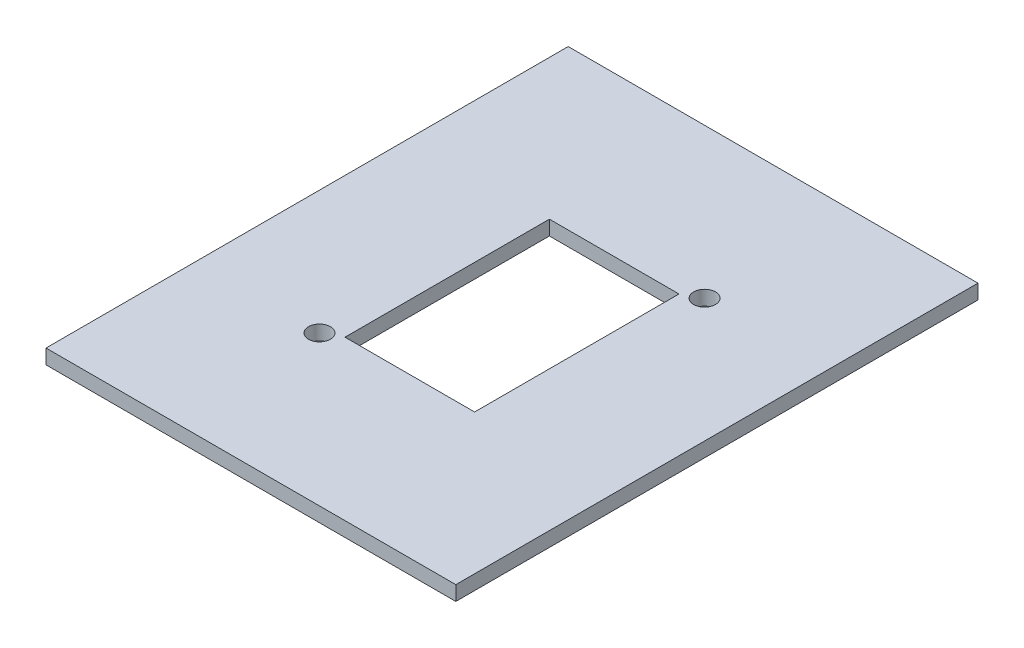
ISO-10303-21;
HEADER;
FILE_DESCRIPTION(('STEP AP214'),'2;1');
FILE_NAME('part.step','',(''),(''),'','','');
FILE_SCHEMA(('AUTOMOTIVE_DESIGN { 1 0 10303 214 1 1 1 1 }'));
ENDSEC;
DATA;
#1=APPLICATION_CONTEXT('core data for automotive mechanical design processes');
#2=APPLICATION_PROTOCOL_DEFINITION('international standard','automotive_design',2000,#1);
#3=PRODUCT_CONTEXT('',#1,'mechanical');
#4=PRODUCT('Part','Part','',(#3));
#5=PRODUCT_RELATED_PRODUCT_CATEGORY('part','',(#4));
#6=PRODUCT_DEFINITION_FORMATION('','',#4);
#7=PRODUCT_DEFINITION_CONTEXT('part definition',#1,'design');
#8=PRODUCT_DEFINITION('design','',#6,#7);
#9=PRODUCT_DEFINITION_SHAPE('','',#8);
#10=(LENGTH_UNIT() NAMED_UNIT(*) SI_UNIT(.MILLI.,.METRE.));
#11=(NAMED_UNIT(*) PLANE_ANGLE_UNIT() SI_UNIT($,.RADIAN.));
#12=(NAMED_UNIT(*) SI_UNIT($,.STERADIAN.) SOLID_ANGLE_UNIT());
#13=UNCERTAINTY_MEASURE_WITH_UNIT(LENGTH_MEASURE(1.E-05),#10,'distance_accuracy_value','');
#14=(GEOMETRIC_REPRESENTATION_CONTEXT(3) GLOBAL_UNCERTAINTY_ASSIGNED_CONTEXT((#13)) GLOBAL_UNIT_ASSIGNED_CONTEXT((#10,
#11,#12)) REPRESENTATION_CONTEXT('',''));
#15=CARTESIAN_POINT('',(0.,0.,0.));
#16=DIRECTION('',(0.,0.,1.));
#17=DIRECTION('',(1.,0.,0.));
#18=AXIS2_PLACEMENT_3D('',#15,#16,#17);
#19=CARTESIAN_POINT('',(0.,2.,0.));
#20=DIRECTION('',(0.,1.,0.));
#21=DIRECTION('',(0.,0.,1.));
#22=AXIS2_PLACEMENT_3D('',#19,#20,#21);
#23=PLANE('',#22);
#24=CARTESIAN_POINT('',(11.125,2.,-15.25));
#25=DIRECTION('',(0.,1.,0.));
#26=DIRECTION('',(0.,0.,1.));
#27=AXIS2_PLACEMENT_3D('',#24,#25,#26);
#28=CIRCLE('',#27,1.5);
#29=CARTESIAN_POINT('',(11.125,2.,-13.75));
#30=VERTEX_POINT('',#29);
#31=EDGE_CURVE('E140',#30,#30,#28,.T.);
#32=ORIENTED_EDGE('',*,*,#31,.F.);
#33=EDGE_LOOP('',(#32));
#34=FACE_BOUND('',#33,.T.);
#35=DIRECTION('',(0.,0.,-1.));
#36=VECTOR('',#35,1.);
#37=CARTESIAN_POINT('',(28.067645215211,2.,-35.7649394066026));
#38=LINE('',#37,#36);
#39=CARTESIAN_POINT('',(28.067645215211,2.,35.7649394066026));
#40=VERTEX_POINT('',#39);
#41=CARTESIAN_POINT('',(28.067645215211,2.,-35.7649394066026));
#42=VERTEX_POINT('',#41);
#43=EDGE_CURVE('E156',#40,#42,#38,.T.);
#44=ORIENTED_EDGE('',*,*,#43,.T.);
#45=DIRECTION('',(-1.,0.,0.));
#46=VECTOR('',#45,1.);
#47=CARTESIAN_POINT('',(-28.067645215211,2.,-35.7649394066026));
#48=LINE('',#47,#46);
#49=CARTESIAN_POINT('',(-28.067645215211,2.,-35.7649394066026));
#50=VERTEX_POINT('',#49);
#51=EDGE_CURVE('E160',#42,#50,#48,.T.);
#52=ORIENTED_EDGE('',*,*,#51,.T.);
#53=DIRECTION('',(0.,0.,1.));
#54=VECTOR('',#53,1.);
#55=CARTESIAN_POINT('',(-28.067645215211,2.,-35.7649394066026));
#56=LINE('',#55,#54);
#57=CARTESIAN_POINT('',(-28.067645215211,2.,35.7649394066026));
#58=VERTEX_POINT('',#57);
#59=EDGE_CURVE('E164',#50,#58,#56,.T.);
#60=ORIENTED_EDGE('',*,*,#59,.T.);
#61=DIRECTION('',(1.,0.,0.));
#62=VECTOR('',#61,1.);
#63=CARTESIAN_POINT('',(-28.067645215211,2.,35.7649394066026));
#64=LINE('',#63,#62);
#65=EDGE_CURVE('E167',#58,#40,#64,.T.);
#66=ORIENTED_EDGE('',*,*,#65,.T.);
#67=EDGE_LOOP('',(#44,#52,#60,#66));
#68=FACE_BOUND('',#67,.T.);
#69=DIRECTION('',(-1.,0.,0.));
#70=VECTOR('',#69,1.);
#71=CARTESIAN_POINT('',(-8.875,2.,-14.));
#72=LINE('',#71,#70);
#73=CARTESIAN_POINT('',(8.875,2.,-14.));
#74=VERTEX_POINT('',#73);
#75=CARTESIAN_POINT('',(-8.875,2.,-14.));
#76=VERTEX_POINT('',#75);
#77=EDGE_CURVE('E114',#74,#76,#72,.T.);
#78=ORIENTED_EDGE('',*,*,#77,.F.);
#79=DIRECTION('',(0.,0.,-1.));
#80=VECTOR('',#79,1.);
#81=CARTESIAN_POINT('',(8.875,2.,-14.));
#82=LINE('',#81,#80);
#83=CARTESIAN_POINT('',(8.875,2.,14.));
#84=VERTEX_POINT('',#83);
#85=EDGE_CURVE('E105',#84,#74,#82,.T.);
#86=ORIENTED_EDGE('',*,*,#85,.F.);
#87=DIRECTION('',(1.,0.,0.));
#88=VECTOR('',#87,1.);
#89=CARTESIAN_POINT('',(-8.875,2.,14.));
#90=LINE('',#89,#88);
#91=CARTESIAN_POINT('',(-8.875,2.,14.));
#92=VERTEX_POINT('',#91);
#93=EDGE_CURVE('E132',#92,#84,#90,.T.);
#94=ORIENTED_EDGE('',*,*,#93,.F.);
#95=DIRECTION('',(0.,0.,1.));
#96=VECTOR('',#95,1.);
#97=CARTESIAN_POINT('',(-8.875,2.,-14.));
#98=LINE('',#97,#96);
#99=EDGE_CURVE('E128',#76,#92,#98,.T.);
#100=ORIENTED_EDGE('',*,*,#99,.F.);
#101=EDGE_LOOP('',(#78,#86,#94,#100));
#102=FACE_BOUND('',#101,.T.);
#103=CARTESIAN_POINT('',(-11.125,2.,15.25));
#104=DIRECTION('',(0.,1.,0.));
#105=DIRECTION('',(0.,0.,1.));
#106=AXIS2_PLACEMENT_3D('',#103,#104,#105);
#107=CIRCLE('',#106,1.5);
#108=CARTESIAN_POINT('',(-11.125,2.,16.75));
#109=VERTEX_POINT('',#108);
#110=EDGE_CURVE('E257',#109,#109,#107,.T.);
#111=ORIENTED_EDGE('',*,*,#110,.F.);
#112=EDGE_LOOP('',(#111));
#113=FACE_BOUND('',#112,.T.);
#114=ADVANCED_FACE('F39',(#34,#68,#102,#113),#23,.T.);
#115=CARTESIAN_POINT('',(0.,0.,0.));
#116=DIRECTION('',(0.,1.,0.));
#117=DIRECTION('',(0.,0.,1.));
#118=AXIS2_PLACEMENT_3D('',#115,#116,#117);
#119=PLANE('',#118);
#120=DIRECTION('',(0.,0.,-1.));
#121=VECTOR('',#120,1.);
#122=CARTESIAN_POINT('',(28.067645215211,0.,-35.7649394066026));
#123=LINE('',#122,#121);
#124=CARTESIAN_POINT('',(28.067645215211,0.,35.7649394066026));
#125=VERTEX_POINT('',#124);
#126=CARTESIAN_POINT('',(28.067645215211,0.,-35.7649394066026));
#127=VERTEX_POINT('',#126);
#128=EDGE_CURVE('E123',#125,#127,#123,.T.);
#129=ORIENTED_EDGE('',*,*,#128,.F.);
#130=DIRECTION('',(1.,0.,0.));
#131=VECTOR('',#130,1.);
#132=CARTESIAN_POINT('',(-28.067645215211,0.,35.7649394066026));
#133=LINE('',#132,#131);
#134=CARTESIAN_POINT('',(-28.067645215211,0.,35.7649394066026));
#135=VERTEX_POINT('',#134);
#136=EDGE_CURVE('E161',#135,#125,#133,.T.);
#137=ORIENTED_EDGE('',*,*,#136,.F.);
#138=DIRECTION('',(0.,0.,1.));
#139=VECTOR('',#138,1.);
#140=CARTESIAN_POINT('',(-28.067645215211,0.,-35.7649394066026));
#141=LINE('',#140,#139);
#142=CARTESIAN_POINT('',(-28.067645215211,0.,-35.7649394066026));
#143=VERTEX_POINT('',#142);
#144=EDGE_CURVE('E177',#143,#135,#141,.T.);
#145=ORIENTED_EDGE('',*,*,#144,.F.);
#146=DIRECTION('',(-1.,0.,0.));
#147=VECTOR('',#146,1.);
#148=CARTESIAN_POINT('',(-28.067645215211,0.,-35.7649394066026));
#149=LINE('',#148,#147);
#150=EDGE_CURVE('E174',#127,#143,#149,.T.);
#151=ORIENTED_EDGE('',*,*,#150,.F.);
#152=EDGE_LOOP('',(#129,#137,#145,#151));
#153=FACE_BOUND('',#152,.T.);
#154=DIRECTION('',(0.,0.,-1.));
#155=VECTOR('',#154,1.);
#156=CARTESIAN_POINT('',(8.875,0.,-14.));
#157=LINE('',#156,#155);
#158=CARTESIAN_POINT('',(8.875,0.,14.));
#159=VERTEX_POINT('',#158);
#160=CARTESIAN_POINT('',(8.875,0.,-14.));
#161=VERTEX_POINT('',#160);
#162=EDGE_CURVE('E63',#159,#161,#157,.T.);
#163=ORIENTED_EDGE('',*,*,#162,.T.);
#164=DIRECTION('',(-1.,0.,0.));
#165=VECTOR('',#164,1.);
#166=CARTESIAN_POINT('',(-8.875,0.,-14.));
#167=LINE('',#166,#165);
#168=CARTESIAN_POINT('',(-8.875,0.,-14.));
#169=VERTEX_POINT('',#168);
#170=EDGE_CURVE('E121',#161,#169,#167,.T.);
#171=ORIENTED_EDGE('',*,*,#170,.T.);
#172=DIRECTION('',(0.,0.,1.));
#173=VECTOR('',#172,1.);
#174=CARTESIAN_POINT('',(-8.875,0.,-14.));
#175=LINE('',#174,#173);
#176=CARTESIAN_POINT('',(-8.875,0.,14.));
#177=VERTEX_POINT('',#176);
#178=EDGE_CURVE('E143',#169,#177,#175,.T.);
#179=ORIENTED_EDGE('',*,*,#178,.T.);
#180=DIRECTION('',(1.,0.,0.));
#181=VECTOR('',#180,1.);
#182=CARTESIAN_POINT('',(-8.875,0.,14.));
#183=LINE('',#182,#181);
#184=EDGE_CURVE('E115',#177,#159,#183,.T.);
#185=ORIENTED_EDGE('',*,*,#184,.T.);
#186=EDGE_LOOP('',(#163,#171,#179,#185));
#187=FACE_BOUND('',#186,.T.);
#188=CARTESIAN_POINT('',(11.125,0.,-15.25));
#189=DIRECTION('',(0.,1.,0.));
#190=DIRECTION('',(0.,0.,1.));
#191=AXIS2_PLACEMENT_3D('',#188,#189,#190);
#192=CIRCLE('',#191,1.5);
#193=CARTESIAN_POINT('',(11.125,0.,-13.75));
#194=VERTEX_POINT('',#193);
#195=EDGE_CURVE('E265',#194,#194,#192,.T.);
#196=ORIENTED_EDGE('',*,*,#195,.T.);
#197=EDGE_LOOP('',(#196));
#198=FACE_BOUND('',#197,.T.);
#199=CARTESIAN_POINT('',(-11.125,0.,15.25));
#200=DIRECTION('',(0.,1.,0.));
#201=DIRECTION('',(0.,0.,1.));
#202=AXIS2_PLACEMENT_3D('',#199,#200,#201);
#203=CIRCLE('',#202,1.5);
#204=CARTESIAN_POINT('',(-11.125,0.,16.75));
#205=VERTEX_POINT('',#204);
#206=EDGE_CURVE('E260',#205,#205,#203,.T.);
#207=ORIENTED_EDGE('',*,*,#206,.T.);
#208=EDGE_LOOP('',(#207));
#209=FACE_BOUND('',#208,.T.);
#210=ADVANCED_FACE('F200',(#153,#187,#198,#209),#119,.F.);
#211=CARTESIAN_POINT('',(28.067645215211,2.,-35.7649394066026));
#212=DIRECTION('',(-1.,0.,0.));
#213=DIRECTION('',(0.,0.,1.));
#214=AXIS2_PLACEMENT_3D('',#211,#212,#213);
#215=PLANE('',#214);
#216=ORIENTED_EDGE('',*,*,#128,.T.);
#217=DIRECTION('',(0.,-1.,0.));
#218=VECTOR('',#217,1.);
#219=CARTESIAN_POINT('',(28.067645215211,2.,-35.7649394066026));
#220=LINE('',#219,#218);
#221=EDGE_CURVE('E11',#42,#127,#220,.T.);
#222=ORIENTED_EDGE('',*,*,#221,.F.);
#223=ORIENTED_EDGE('',*,*,#43,.F.);
#224=DIRECTION('',(0.,-1.,0.));
#225=VECTOR('',#224,1.);
#226=CARTESIAN_POINT('',(28.067645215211,2.,35.7649394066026));
#227=LINE('',#226,#225);
#228=EDGE_CURVE('E170',#40,#125,#227,.T.);
#229=ORIENTED_EDGE('',*,*,#228,.T.);
#230=EDGE_LOOP('',(#216,#222,#223,#229));
#231=FACE_BOUND('',#230,.T.);
#232=ADVANCED_FACE('F41',(#231),#215,.F.);
#233=CARTESIAN_POINT('',(-28.067645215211,2.,-35.7649394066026));
#234=DIRECTION('',(0.,0.,1.));
#235=DIRECTION('',(1.,0.,0.));
#236=AXIS2_PLACEMENT_3D('',#233,#234,#235);
#237=PLANE('',#236);
#238=ORIENTED_EDGE('',*,*,#150,.T.);
#239=DIRECTION('',(0.,-1.,0.));
#240=VECTOR('',#239,1.);
#241=CARTESIAN_POINT('',(-28.067645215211,2.,-35.7649394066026));
#242=LINE('',#241,#240);
#243=EDGE_CURVE('E48',#50,#143,#242,.T.);
#244=ORIENTED_EDGE('',*,*,#243,.F.);
#245=ORIENTED_EDGE('',*,*,#51,.F.);
#246=ORIENTED_EDGE('',*,*,#221,.T.);
#247=EDGE_LOOP('',(#238,#244,#245,#246));
#248=FACE_BOUND('',#247,.T.);
#249=ADVANCED_FACE('F210',(#248),#237,.F.);
#250=CARTESIAN_POINT('',(-28.067645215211,2.,-35.7649394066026));
#251=DIRECTION('',(1.,0.,0.));
#252=DIRECTION('',(0.,0.,-1.));
#253=AXIS2_PLACEMENT_3D('',#250,#251,#252);
#254=PLANE('',#253);
#255=ORIENTED_EDGE('',*,*,#144,.T.);
#256=DIRECTION('',(0.,-1.,0.));
#257=VECTOR('',#256,1.);
#258=CARTESIAN_POINT('',(-28.067645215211,2.,35.7649394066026));
#259=LINE('',#258,#257);
#260=EDGE_CURVE('E185',#58,#135,#259,.T.);
#261=ORIENTED_EDGE('',*,*,#260,.F.);
#262=ORIENTED_EDGE('',*,*,#59,.F.);
#263=ORIENTED_EDGE('',*,*,#243,.T.);
#264=EDGE_LOOP('',(#255,#261,#262,#263));
#265=FACE_BOUND('',#264,.T.);
#266=ADVANCED_FACE('F194',(#265),#254,.F.);
#267=CARTESIAN_POINT('',(-28.067645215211,2.,35.7649394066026));
#268=DIRECTION('',(0.,0.,-1.));
#269=DIRECTION('',(-1.,0.,0.));
#270=AXIS2_PLACEMENT_3D('',#267,#268,#269);
#271=PLANE('',#270);
#272=ORIENTED_EDGE('',*,*,#136,.T.);
#273=ORIENTED_EDGE('',*,*,#228,.F.);
#274=ORIENTED_EDGE('',*,*,#65,.F.);
#275=ORIENTED_EDGE('',*,*,#260,.T.);
#276=EDGE_LOOP('',(#272,#273,#274,#275));
#277=FACE_BOUND('',#276,.T.);
#278=ADVANCED_FACE('F204',(#277),#271,.F.);
#279=CARTESIAN_POINT('',(8.875,2.,-14.));
#280=DIRECTION('',(-1.,0.,0.));
#281=DIRECTION('',(0.,0.,1.));
#282=AXIS2_PLACEMENT_3D('',#279,#280,#281);
#283=PLANE('',#282);
#284=ORIENTED_EDGE('',*,*,#162,.F.);
#285=DIRECTION('',(0.,-1.,0.));
#286=VECTOR('',#285,1.);
#287=CARTESIAN_POINT('',(8.875,2.,14.));
#288=LINE('',#287,#286);
#289=EDGE_CURVE('E109',#84,#159,#288,.T.);
#290=ORIENTED_EDGE('',*,*,#289,.F.);
#291=ORIENTED_EDGE('',*,*,#85,.T.);
#292=DIRECTION('',(0.,-1.,0.));
#293=VECTOR('',#292,1.);
#294=CARTESIAN_POINT('',(8.875,2.,-14.));
#295=LINE('',#294,#293);
#296=EDGE_CURVE('E108',#74,#161,#295,.T.);
#297=ORIENTED_EDGE('',*,*,#296,.T.);
#298=EDGE_LOOP('',(#284,#290,#291,#297));
#299=FACE_BOUND('',#298,.T.);
#300=ADVANCED_FACE('F107',(#299),#283,.T.);
#301=CARTESIAN_POINT('',(-8.875,2.,-14.));
#302=DIRECTION('',(0.,0.,1.));
#303=DIRECTION('',(1.,0.,0.));
#304=AXIS2_PLACEMENT_3D('',#301,#302,#303);
#305=PLANE('',#304);
#306=ORIENTED_EDGE('',*,*,#170,.F.);
#307=ORIENTED_EDGE('',*,*,#296,.F.);
#308=ORIENTED_EDGE('',*,*,#77,.T.);
#309=DIRECTION('',(0.,-1.,0.));
#310=VECTOR('',#309,1.);
#311=CARTESIAN_POINT('',(-8.875,2.,-14.));
#312=LINE('',#311,#310);
#313=EDGE_CURVE('E124',#76,#169,#312,.T.);
#314=ORIENTED_EDGE('',*,*,#313,.T.);
#315=EDGE_LOOP('',(#306,#307,#308,#314));
#316=FACE_BOUND('',#315,.T.);
#317=ADVANCED_FACE('F118',(#316),#305,.T.);
#318=CARTESIAN_POINT('',(-8.875,2.,-14.));
#319=DIRECTION('',(1.,0.,0.));
#320=DIRECTION('',(0.,0.,-1.));
#321=AXIS2_PLACEMENT_3D('',#318,#319,#320);
#322=PLANE('',#321);
#323=ORIENTED_EDGE('',*,*,#178,.F.);
#324=ORIENTED_EDGE('',*,*,#313,.F.);
#325=ORIENTED_EDGE('',*,*,#99,.T.);
#326=DIRECTION('',(0.,-1.,0.));
#327=VECTOR('',#326,1.);
#328=CARTESIAN_POINT('',(-8.875,2.,14.));
#329=LINE('',#328,#327);
#330=EDGE_CURVE('E55',#92,#177,#329,.T.);
#331=ORIENTED_EDGE('',*,*,#330,.T.);
#332=EDGE_LOOP('',(#323,#324,#325,#331));
#333=FACE_BOUND('',#332,.T.);
#334=ADVANCED_FACE('F235',(#333),#322,.T.);
#335=CARTESIAN_POINT('',(-8.875,2.,14.));
#336=DIRECTION('',(0.,0.,-1.));
#337=DIRECTION('',(-1.,0.,0.));
#338=AXIS2_PLACEMENT_3D('',#335,#336,#337);
#339=PLANE('',#338);
#340=ORIENTED_EDGE('',*,*,#184,.F.);
#341=ORIENTED_EDGE('',*,*,#330,.F.);
#342=ORIENTED_EDGE('',*,*,#93,.T.);
#343=ORIENTED_EDGE('',*,*,#289,.T.);
#344=EDGE_LOOP('',(#340,#341,#342,#343));
#345=FACE_BOUND('',#344,.T.);
#346=ADVANCED_FACE('F239',(#345),#339,.T.);
#347=CARTESIAN_POINT('',(11.125,2.,-15.25));
#348=DIRECTION('',(0.,-1.,0.));
#349=DIRECTION('',(0.,0.,-1.));
#350=AXIS2_PLACEMENT_3D('',#347,#348,#349);
#351=CYLINDRICAL_SURFACE('',#350,1.5);
#352=ORIENTED_EDGE('',*,*,#31,.T.);
#353=EDGE_LOOP('',(#352));
#354=FACE_BOUND('',#353,.T.);
#355=ORIENTED_EDGE('',*,*,#195,.F.);
#356=EDGE_LOOP('',(#355));
#357=FACE_BOUND('',#356,.T.);
#358=ADVANCED_FACE('F245',(#354,#357),#351,.F.);
#359=CARTESIAN_POINT('',(-11.125,2.,15.25));
#360=DIRECTION('',(0.,-1.,0.));
#361=DIRECTION('',(0.,0.,-1.));
#362=AXIS2_PLACEMENT_3D('',#359,#360,#361);
#363=CYLINDRICAL_SURFACE('',#362,1.5);
#364=ORIENTED_EDGE('',*,*,#110,.T.);
#365=EDGE_LOOP('',(#364));
#366=FACE_BOUND('',#365,.T.);
#367=ORIENTED_EDGE('',*,*,#206,.F.);
#368=EDGE_LOOP('',(#367));
#369=FACE_BOUND('',#368,.T.);
#370=ADVANCED_FACE('F248',(#366,#369),#363,.F.);
#371=CLOSED_SHELL('',(#114,#210,#232,#249,#266,#278,#300,#317,#334,#346,#358,#370));
#372=MANIFOLD_SOLID_BREP('B2',#371);
#373=ADVANCED_BREP_SHAPE_REPRESENTATION('',(#18,#372),#14);
#374=SHAPE_DEFINITION_REPRESENTATION(#9,#373);
ENDSEC;
END-ISO-10303-21;
